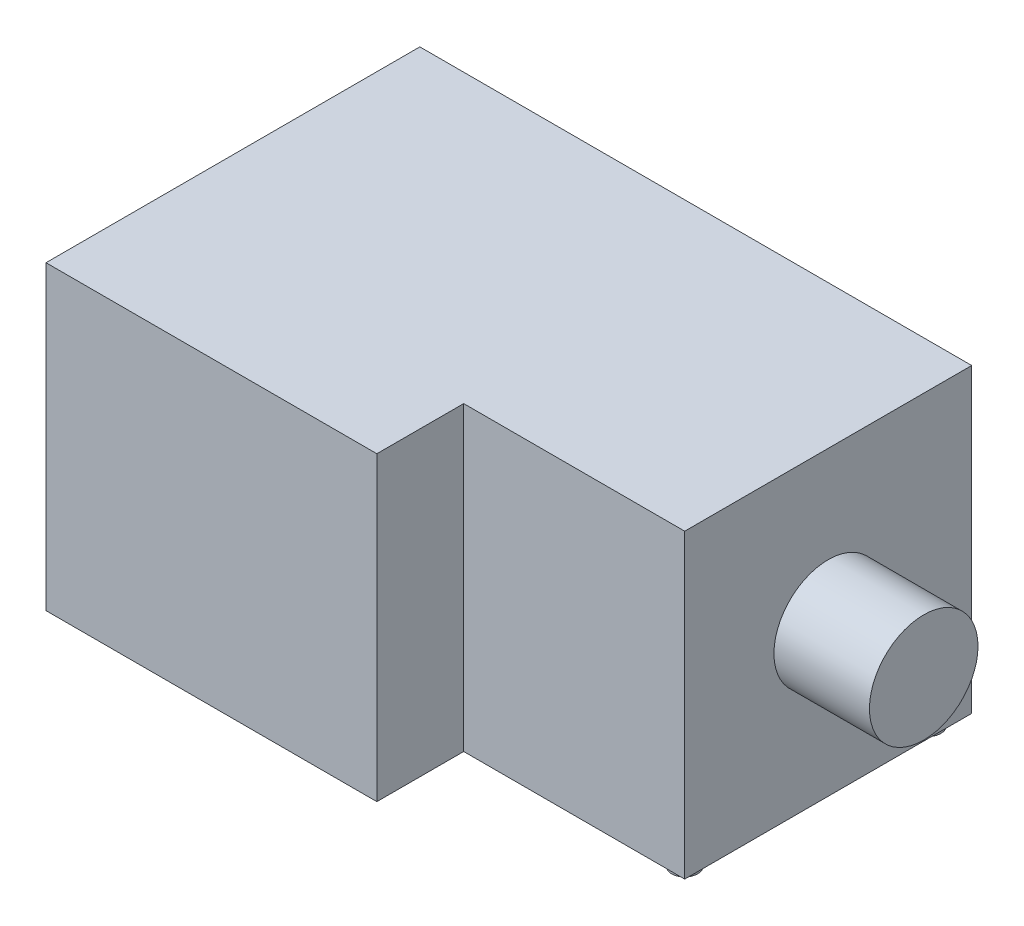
ISO-10303-21;
HEADER;
FILE_DESCRIPTION(('STEP AP214'),'2;1');
FILE_NAME('part.step','',(''),(''),'','','');
FILE_SCHEMA(('AUTOMOTIVE_DESIGN { 1 0 10303 214 1 1 1 1 }'));
ENDSEC;
DATA;
#1=APPLICATION_CONTEXT('core data for automotive mechanical design processes');
#2=APPLICATION_PROTOCOL_DEFINITION('international standard','automotive_design',2000,#1);
#3=PRODUCT_CONTEXT('',#1,'mechanical');
#4=PRODUCT('Part','Part','',(#3));
#5=PRODUCT_RELATED_PRODUCT_CATEGORY('part','',(#4));
#6=PRODUCT_DEFINITION_FORMATION('','',#4);
#7=PRODUCT_DEFINITION_CONTEXT('part definition',#1,'design');
#8=PRODUCT_DEFINITION('design','',#6,#7);
#9=PRODUCT_DEFINITION_SHAPE('','',#8);
#10=(LENGTH_UNIT() NAMED_UNIT(*) SI_UNIT(.MILLI.,.METRE.));
#11=(NAMED_UNIT(*) PLANE_ANGLE_UNIT() SI_UNIT($,.RADIAN.));
#12=(NAMED_UNIT(*) SI_UNIT($,.STERADIAN.) SOLID_ANGLE_UNIT());
#13=UNCERTAINTY_MEASURE_WITH_UNIT(LENGTH_MEASURE(1.E-05),#10,'distance_accuracy_value','');
#14=(GEOMETRIC_REPRESENTATION_CONTEXT(3) GLOBAL_UNCERTAINTY_ASSIGNED_CONTEXT((#13)) GLOBAL_UNIT_ASSIGNED_CONTEXT((#10,
#11,#12)) REPRESENTATION_CONTEXT('',''));
#15=CARTESIAN_POINT('',(0.,0.,0.));
#16=DIRECTION('',(0.,0.,1.));
#17=DIRECTION('',(1.,0.,0.));
#18=AXIS2_PLACEMENT_3D('',#15,#16,#17);
#19=CARTESIAN_POINT('',(0.,694.,0.));
#20=DIRECTION('',(0.,0.,-1.));
#21=DIRECTION('',(-1.,0.,0.));
#22=AXIS2_PLACEMENT_3D('',#19,#20,#21);
#23=PLANE('',#22);
#24=DIRECTION('',(1.,0.,0.));
#25=VECTOR('',#24,1.);
#26=CARTESIAN_POINT('',(0.,0.,0.));
#27=LINE('',#26,#25);
#28=CARTESIAN_POINT('',(762.,0.,0.));
#29=VERTEX_POINT('',#28);
#30=CARTESIAN_POINT('',(1271.,0.,0.));
#31=VERTEX_POINT('',#30);
#32=EDGE_CURVE('E131',#29,#31,#27,.T.);
#33=ORIENTED_EDGE('',*,*,#32,.T.);
#34=DIRECTION('',(0.,-1.,0.));
#35=VECTOR('',#34,1.);
#36=CARTESIAN_POINT('',(1271.,694.,0.));
#37=LINE('',#36,#35);
#38=CARTESIAN_POINT('',(1271.,694.,0.));
#39=VERTEX_POINT('',#38);
#40=EDGE_CURVE('E153',#39,#31,#37,.T.);
#41=ORIENTED_EDGE('',*,*,#40,.F.);
#42=DIRECTION('',(1.,0.,0.));
#43=VECTOR('',#42,1.);
#44=CARTESIAN_POINT('',(0.,694.,0.));
#45=LINE('',#44,#43);
#46=CARTESIAN_POINT('',(762.,694.,0.));
#47=VERTEX_POINT('',#46);
#48=EDGE_CURVE('E146',#47,#39,#45,.T.);
#49=ORIENTED_EDGE('',*,*,#48,.F.);
#50=DIRECTION('',(0.,-1.,0.));
#51=VECTOR('',#50,1.);
#52=CARTESIAN_POINT('',(762.,694.,0.));
#53=LINE('',#52,#51);
#54=EDGE_CURVE('E130',#47,#29,#53,.T.);
#55=ORIENTED_EDGE('',*,*,#54,.T.);
#56=EDGE_LOOP('',(#33,#41,#49,#55));
#57=FACE_BOUND('',#56,.T.);
#58=ADVANCED_FACE('F40',(#57),#23,.F.);
#59=CARTESIAN_POINT('',(1271.,694.,0.));
#60=DIRECTION('',(-1.,0.,0.));
#61=DIRECTION('',(0.,0.,1.));
#62=AXIS2_PLACEMENT_3D('',#59,#60,#61);
#63=PLANE('',#62);
#64=CARTESIAN_POINT('',(1271.,347.,-330.5));
#65=DIRECTION('',(-1.,0.,0.));
#66=DIRECTION('',(0.,0.,1.));
#67=AXIS2_PLACEMENT_3D('',#64,#65,#66);
#68=CIRCLE('',#67,125.);
#69=CARTESIAN_POINT('',(1271.,347.,-205.5));
#70=VERTEX_POINT('',#69);
#71=EDGE_CURVE('E156',#70,#70,#68,.F.);
#72=ORIENTED_EDGE('',*,*,#71,.F.);
#73=EDGE_LOOP('',(#72));
#74=FACE_BOUND('',#73,.T.);
#75=DIRECTION('',(0.,0.,-1.));
#76=VECTOR('',#75,1.);
#77=CARTESIAN_POINT('',(1271.,0.,0.));
#78=LINE('',#77,#76);
#79=CARTESIAN_POINT('',(1271.,0.,-661.));
#80=VERTEX_POINT('',#79);
#81=EDGE_CURVE('E135',#31,#80,#78,.T.);
#82=ORIENTED_EDGE('',*,*,#81,.T.);
#83=DIRECTION('',(0.,-1.,0.));
#84=VECTOR('',#83,1.);
#85=CARTESIAN_POINT('',(1271.,694.,-661.));
#86=LINE('',#85,#84);
#87=CARTESIAN_POINT('',(1271.,694.,-661.));
#88=VERTEX_POINT('',#87);
#89=EDGE_CURVE('E151',#88,#80,#86,.T.);
#90=ORIENTED_EDGE('',*,*,#89,.F.);
#91=DIRECTION('',(0.,0.,-1.));
#92=VECTOR('',#91,1.);
#93=CARTESIAN_POINT('',(1271.,694.,0.));
#94=LINE('',#93,#92);
#95=EDGE_CURVE('E97',#39,#88,#94,.T.);
#96=ORIENTED_EDGE('',*,*,#95,.F.);
#97=ORIENTED_EDGE('',*,*,#40,.T.);
#98=EDGE_LOOP('',(#82,#90,#96,#97));
#99=FACE_BOUND('',#98,.T.);
#100=ADVANCED_FACE('F196',(#74,#99),#63,.F.);
#101=CARTESIAN_POINT('',(0.,694.,-661.));
#102=DIRECTION('',(0.,0.,-1.));
#103=DIRECTION('',(-1.,0.,0.));
#104=AXIS2_PLACEMENT_3D('',#101,#102,#103);
#105=PLANE('',#104);
#106=DIRECTION('',(1.,0.,0.));
#107=VECTOR('',#106,1.);
#108=CARTESIAN_POINT('',(0.,0.,-661.));
#109=LINE('',#108,#107);
#110=CARTESIAN_POINT('',(0.,0.,-661.));
#111=VERTEX_POINT('',#110);
#112=EDGE_CURVE('E140',#111,#80,#109,.T.);
#113=ORIENTED_EDGE('',*,*,#112,.F.);
#114=DIRECTION('',(0.,-1.,0.));
#115=VECTOR('',#114,1.);
#116=CARTESIAN_POINT('',(0.,694.,-661.));
#117=LINE('',#116,#115);
#118=CARTESIAN_POINT('',(0.,694.,-661.));
#119=VERTEX_POINT('',#118);
#120=EDGE_CURVE('E113',#119,#111,#117,.T.);
#121=ORIENTED_EDGE('',*,*,#120,.F.);
#122=DIRECTION('',(1.,0.,0.));
#123=VECTOR('',#122,1.);
#124=CARTESIAN_POINT('',(0.,694.,-661.));
#125=LINE('',#124,#123);
#126=EDGE_CURVE('E122',#119,#88,#125,.T.);
#127=ORIENTED_EDGE('',*,*,#126,.T.);
#128=ORIENTED_EDGE('',*,*,#89,.T.);
#129=EDGE_LOOP('',(#113,#121,#127,#128));
#130=FACE_BOUND('',#129,.T.);
#131=ADVANCED_FACE('F200',(#130),#105,.T.);
#132=CARTESIAN_POINT('',(0.,694.,0.));
#133=DIRECTION('',(-1.,0.,0.));
#134=DIRECTION('',(0.,0.,1.));
#135=AXIS2_PLACEMENT_3D('',#132,#133,#134);
#136=PLANE('',#135);
#137=DIRECTION('',(0.,0.,-1.));
#138=VECTOR('',#137,1.);
#139=CARTESIAN_POINT('',(0.,0.,0.));
#140=LINE('',#139,#138);
#141=CARTESIAN_POINT('',(0.,0.,200.));
#142=VERTEX_POINT('',#141);
#143=EDGE_CURVE('E112',#142,#111,#140,.T.);
#144=ORIENTED_EDGE('',*,*,#143,.F.);
#145=DIRECTION('',(0.,-1.,0.));
#146=VECTOR('',#145,1.);
#147=CARTESIAN_POINT('',(0.,694.,200.));
#148=LINE('',#147,#146);
#149=CARTESIAN_POINT('',(0.,694.,200.));
#150=VERTEX_POINT('',#149);
#151=EDGE_CURVE('E106',#150,#142,#148,.T.);
#152=ORIENTED_EDGE('',*,*,#151,.F.);
#153=DIRECTION('',(0.,0.,-1.));
#154=VECTOR('',#153,1.);
#155=CARTESIAN_POINT('',(0.,694.,0.));
#156=LINE('',#155,#154);
#157=EDGE_CURVE('E110',#150,#119,#156,.T.);
#158=ORIENTED_EDGE('',*,*,#157,.T.);
#159=ORIENTED_EDGE('',*,*,#120,.T.);
#160=EDGE_LOOP('',(#144,#152,#158,#159));
#161=FACE_BOUND('',#160,.T.);
#162=ADVANCED_FACE('F108',(#161),#136,.T.);
#163=CARTESIAN_POINT('',(0.,694.,200.));
#164=DIRECTION('',(0.,0.,-1.));
#165=DIRECTION('',(-1.,0.,0.));
#166=AXIS2_PLACEMENT_3D('',#163,#164,#165);
#167=PLANE('',#166);
#168=DIRECTION('',(1.,0.,0.));
#169=VECTOR('',#168,1.);
#170=CARTESIAN_POINT('',(0.,0.,200.));
#171=LINE('',#170,#169);
#172=CARTESIAN_POINT('',(762.,0.,200.));
#173=VERTEX_POINT('',#172);
#174=EDGE_CURVE('E82',#142,#173,#171,.T.);
#175=ORIENTED_EDGE('',*,*,#174,.T.);
#176=DIRECTION('',(0.,-1.,0.));
#177=VECTOR('',#176,1.);
#178=CARTESIAN_POINT('',(762.,694.,200.));
#179=LINE('',#178,#177);
#180=CARTESIAN_POINT('',(762.,694.,200.));
#181=VERTEX_POINT('',#180);
#182=EDGE_CURVE('E114',#181,#173,#179,.T.);
#183=ORIENTED_EDGE('',*,*,#182,.F.);
#184=DIRECTION('',(1.,0.,0.));
#185=VECTOR('',#184,1.);
#186=CARTESIAN_POINT('',(0.,694.,200.));
#187=LINE('',#186,#185);
#188=EDGE_CURVE('E116',#150,#181,#187,.T.);
#189=ORIENTED_EDGE('',*,*,#188,.F.);
#190=ORIENTED_EDGE('',*,*,#151,.T.);
#191=EDGE_LOOP('',(#175,#183,#189,#190));
#192=FACE_BOUND('',#191,.T.);
#193=ADVANCED_FACE('F117',(#192),#167,.F.);
#194=CARTESIAN_POINT('',(762.,694.,0.));
#195=DIRECTION('',(-1.,0.,0.));
#196=DIRECTION('',(0.,0.,1.));
#197=AXIS2_PLACEMENT_3D('',#194,#195,#196);
#198=PLANE('',#197);
#199=DIRECTION('',(0.,0.,-1.));
#200=VECTOR('',#199,1.);
#201=CARTESIAN_POINT('',(762.,0.,0.));
#202=LINE('',#201,#200);
#203=EDGE_CURVE('E88',#173,#29,#202,.T.);
#204=ORIENTED_EDGE('',*,*,#203,.T.);
#205=ORIENTED_EDGE('',*,*,#54,.F.);
#206=DIRECTION('',(0.,0.,-1.));
#207=VECTOR('',#206,1.);
#208=CARTESIAN_POINT('',(762.,694.,0.));
#209=LINE('',#208,#207);
#210=EDGE_CURVE('E59',#181,#47,#209,.T.);
#211=ORIENTED_EDGE('',*,*,#210,.F.);
#212=ORIENTED_EDGE('',*,*,#182,.T.);
#213=EDGE_LOOP('',(#204,#205,#211,#212));
#214=FACE_BOUND('',#213,.T.);
#215=ADVANCED_FACE('F186',(#214),#198,.F.);
#216=CARTESIAN_POINT('',(0.,694.,0.));
#217=DIRECTION('',(0.,1.,0.));
#218=DIRECTION('',(0.,0.,1.));
#219=AXIS2_PLACEMENT_3D('',#216,#217,#218);
#220=PLANE('',#219);
#221=ORIENTED_EDGE('',*,*,#48,.T.);
#222=ORIENTED_EDGE('',*,*,#95,.T.);
#223=ORIENTED_EDGE('',*,*,#126,.F.);
#224=ORIENTED_EDGE('',*,*,#157,.F.);
#225=ORIENTED_EDGE('',*,*,#188,.T.);
#226=ORIENTED_EDGE('',*,*,#210,.T.);
#227=EDGE_LOOP('',(#221,#222,#223,#224,#225,#226));
#228=FACE_BOUND('',#227,.T.);
#229=ADVANCED_FACE('F120',(#228),#220,.T.);
#230=CARTESIAN_POINT('',(0.,0.,0.));
#231=DIRECTION('',(0.,1.,0.));
#232=DIRECTION('',(0.,0.,1.));
#233=AXIS2_PLACEMENT_3D('',#230,#231,#232);
#234=PLANE('',#233);
#235=CARTESIAN_POINT('',(1220.5,0.,-50.5));
#236=DIRECTION('',(0.,1.,0.));
#237=DIRECTION('',(0.,0.,1.));
#238=AXIS2_PLACEMENT_3D('',#235,#236,#237);
#239=CIRCLE('',#238,30.);
#240=CARTESIAN_POINT('',(1220.5,0.,-20.4999999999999));
#241=VERTEX_POINT('',#240);
#242=EDGE_CURVE('E11',#241,#241,#239,.F.);
#243=ORIENTED_EDGE('',*,*,#242,.F.);
#244=EDGE_LOOP('',(#243));
#245=FACE_BOUND('',#244,.T.);
#246=CARTESIAN_POINT('',(1220.5,0.,-610.5));
#247=DIRECTION('',(0.,1.,0.));
#248=DIRECTION('',(0.,0.,1.));
#249=AXIS2_PLACEMENT_3D('',#246,#247,#248);
#250=CIRCLE('',#249,30.0000000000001);
#251=CARTESIAN_POINT('',(1220.5,0.,-580.5));
#252=VERTEX_POINT('',#251);
#253=EDGE_CURVE('E49',#252,#252,#250,.F.);
#254=ORIENTED_EDGE('',*,*,#253,.F.);
#255=EDGE_LOOP('',(#254));
#256=FACE_BOUND('',#255,.T.);
#257=CARTESIAN_POINT('',(50.5000000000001,0.,-610.5));
#258=DIRECTION('',(0.,1.,0.));
#259=DIRECTION('',(0.,0.,1.));
#260=AXIS2_PLACEMENT_3D('',#257,#258,#259);
#261=CIRCLE('',#260,30.);
#262=CARTESIAN_POINT('',(50.5000000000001,0.,-580.5));
#263=VERTEX_POINT('',#262);
#264=EDGE_CURVE('E163',#263,#263,#261,.F.);
#265=ORIENTED_EDGE('',*,*,#264,.F.);
#266=EDGE_LOOP('',(#265));
#267=FACE_BOUND('',#266,.T.);
#268=CARTESIAN_POINT('',(50.5,0.,-50.5));
#269=DIRECTION('',(0.,1.,0.));
#270=DIRECTION('',(0.,0.,1.));
#271=AXIS2_PLACEMENT_3D('',#268,#269,#270);
#272=CIRCLE('',#271,30.);
#273=CARTESIAN_POINT('',(50.5,0.,-20.5));
#274=VERTEX_POINT('',#273);
#275=EDGE_CURVE('E160',#274,#274,#272,.F.);
#276=ORIENTED_EDGE('',*,*,#275,.F.);
#277=EDGE_LOOP('',(#276));
#278=FACE_BOUND('',#277,.T.);
#279=ORIENTED_EDGE('',*,*,#32,.F.);
#280=ORIENTED_EDGE('',*,*,#203,.F.);
#281=ORIENTED_EDGE('',*,*,#174,.F.);
#282=ORIENTED_EDGE('',*,*,#143,.T.);
#283=ORIENTED_EDGE('',*,*,#112,.T.);
#284=ORIENTED_EDGE('',*,*,#81,.F.);
#285=EDGE_LOOP('',(#279,#280,#281,#282,#283,#284));
#286=FACE_BOUND('',#285,.T.);
#287=ADVANCED_FACE('F170',(#245,#256,#267,#278,#286),#234,.F.);
#288=CARTESIAN_POINT('',(1491.,347.,-330.5));
#289=DIRECTION('',(-1.,0.,0.));
#290=DIRECTION('',(0.,0.,1.));
#291=AXIS2_PLACEMENT_3D('',#288,#289,#290);
#292=CYLINDRICAL_SURFACE('',#291,125.);
#293=CARTESIAN_POINT('',(1491.,347.,-330.5));
#294=DIRECTION('',(1.,0.,0.));
#295=DIRECTION('',(0.,0.,-1.));
#296=AXIS2_PLACEMENT_3D('',#293,#294,#295);
#297=CIRCLE('',#296,125.);
#298=CARTESIAN_POINT('',(1491.,347.,-455.5));
#299=VERTEX_POINT('',#298);
#300=EDGE_CURVE('E136',#299,#299,#297,.T.);
#301=ORIENTED_EDGE('',*,*,#300,.F.);
#302=EDGE_LOOP('',(#301));
#303=FACE_BOUND('',#302,.T.);
#304=ORIENTED_EDGE('',*,*,#71,.T.);
#305=EDGE_LOOP('',(#304));
#306=FACE_BOUND('',#305,.T.);
#307=ADVANCED_FACE('F173',(#303,#306),#292,.T.);
#308=CARTESIAN_POINT('',(1491.,347.,-330.5));
#309=DIRECTION('',(1.,0.,0.));
#310=DIRECTION('',(0.,0.,-1.));
#311=AXIS2_PLACEMENT_3D('',#308,#309,#310);
#312=PLANE('',#311);
#313=ORIENTED_EDGE('',*,*,#300,.T.);
#314=EDGE_LOOP('',(#313));
#315=FACE_BOUND('',#314,.T.);
#316=ADVANCED_FACE('F246',(#315),#312,.T.);
#317=CARTESIAN_POINT('',(50.5,-25.,-50.5));
#318=DIRECTION('',(0.,-1.,0.));
#319=DIRECTION('',(0.,0.,-1.));
#320=AXIS2_PLACEMENT_3D('',#317,#318,#319);
#321=PLANE('',#320);
#322=CARTESIAN_POINT('',(50.5,-25.,-50.5));
#323=DIRECTION('',(0.,-1.,0.));
#324=DIRECTION('',(0.,0.,-1.));
#325=AXIS2_PLACEMENT_3D('',#322,#323,#324);
#326=CIRCLE('',#325,30.);
#327=CARTESIAN_POINT('',(50.5,-25.,-80.5));
#328=VERTEX_POINT('',#327);
#329=EDGE_CURVE('E462',#328,#328,#326,.T.);
#330=ORIENTED_EDGE('',*,*,#329,.T.);
#331=EDGE_LOOP('',(#330));
#332=FACE_BOUND('',#331,.T.);
#333=CARTESIAN_POINT('',(50.5,-25.,-50.5));
#334=DIRECTION('',(0.,-1.,0.));
#335=DIRECTION('',(0.,0.,-1.));
#336=AXIS2_PLACEMENT_3D('',#333,#334,#335);
#337=CIRCLE('',#336,5.);
#338=CARTESIAN_POINT('',(50.5,-25.,-55.5));
#339=VERTEX_POINT('',#338);
#340=EDGE_CURVE('E459',#339,#339,#337,.T.);
#341=ORIENTED_EDGE('',*,*,#340,.F.);
#342=EDGE_LOOP('',(#341));
#343=FACE_BOUND('',#342,.T.);
#344=ADVANCED_FACE('F257',(#332,#343),#321,.T.);
#345=CARTESIAN_POINT('',(50.5,-25.,-50.5));
#346=DIRECTION('',(0.,1.,0.));
#347=DIRECTION('',(0.,0.,1.));
#348=AXIS2_PLACEMENT_3D('',#345,#346,#347);
#349=CYLINDRICAL_SURFACE('',#348,30.);
#350=ORIENTED_EDGE('',*,*,#329,.F.);
#351=EDGE_LOOP('',(#350));
#352=FACE_BOUND('',#351,.T.);
#353=ORIENTED_EDGE('',*,*,#275,.T.);
#354=EDGE_LOOP('',(#353));
#355=FACE_BOUND('',#354,.T.);
#356=ADVANCED_FACE('F272',(#352,#355),#349,.T.);
#357=CARTESIAN_POINT('',(50.5,-25.,-50.5));
#358=DIRECTION('',(0.,1.,0.));
#359=DIRECTION('',(0.,0.,1.));
#360=AXIS2_PLACEMENT_3D('',#357,#358,#359);
#361=CYLINDRICAL_SURFACE('',#360,5.);
#362=ORIENTED_EDGE('',*,*,#340,.T.);
#363=EDGE_LOOP('',(#362));
#364=FACE_BOUND('',#363,.T.);
#365=CARTESIAN_POINT('',(50.5,0.,-50.5));
#366=DIRECTION('',(0.,-1.,0.));
#367=DIRECTION('',(0.,0.,-1.));
#368=AXIS2_PLACEMENT_3D('',#365,#366,#367);
#369=CIRCLE('',#368,5.);
#370=CARTESIAN_POINT('',(50.5,0.,-55.5));
#371=VERTEX_POINT('',#370);
#372=EDGE_CURVE('E458',#371,#371,#369,.T.);
#373=ORIENTED_EDGE('',*,*,#372,.F.);
#374=EDGE_LOOP('',(#373));
#375=FACE_BOUND('',#374,.T.);
#376=ADVANCED_FACE('F283',(#364,#375),#361,.F.);
#377=ORIENTED_EDGE('',*,*,#372,.T.);
#378=EDGE_LOOP('',(#377));
#379=FACE_BOUND('',#378,.T.);
#380=ADVANCED_FACE('F177',(#379),#234,.F.);
#381=CARTESIAN_POINT('',(50.5000000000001,-25.,-610.5));
#382=DIRECTION('',(0.,-1.,0.));
#383=DIRECTION('',(0.,0.,-1.));
#384=AXIS2_PLACEMENT_3D('',#381,#382,#383);
#385=PLANE('',#384);
#386=CARTESIAN_POINT('',(50.5000000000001,-25.,-610.5));
#387=DIRECTION('',(0.,-1.,0.));
#388=DIRECTION('',(0.,0.,-1.));
#389=AXIS2_PLACEMENT_3D('',#386,#387,#388);
#390=CIRCLE('',#389,30.);
#391=CARTESIAN_POINT('',(50.5000000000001,-25.,-640.5));
#392=VERTEX_POINT('',#391);
#393=EDGE_CURVE('E453',#392,#392,#390,.T.);
#394=ORIENTED_EDGE('',*,*,#393,.T.);
#395=EDGE_LOOP('',(#394));
#396=FACE_BOUND('',#395,.T.);
#397=CARTESIAN_POINT('',(50.5000000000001,-25.,-610.5));
#398=DIRECTION('',(0.,-1.,0.));
#399=DIRECTION('',(0.,0.,-1.));
#400=AXIS2_PLACEMENT_3D('',#397,#398,#399);
#401=CIRCLE('',#400,5.);
#402=CARTESIAN_POINT('',(50.5000000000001,-25.,-615.5));
#403=VERTEX_POINT('',#402);
#404=EDGE_CURVE('E450',#403,#403,#401,.T.);
#405=ORIENTED_EDGE('',*,*,#404,.F.);
#406=EDGE_LOOP('',(#405));
#407=FACE_BOUND('',#406,.T.);
#408=ADVANCED_FACE('F303',(#396,#407),#385,.T.);
#409=CARTESIAN_POINT('',(50.5000000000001,-25.,-610.5));
#410=DIRECTION('',(0.,1.,0.));
#411=DIRECTION('',(0.,0.,1.));
#412=AXIS2_PLACEMENT_3D('',#409,#410,#411);
#413=CYLINDRICAL_SURFACE('',#412,30.);
#414=ORIENTED_EDGE('',*,*,#393,.F.);
#415=EDGE_LOOP('',(#414));
#416=FACE_BOUND('',#415,.T.);
#417=ORIENTED_EDGE('',*,*,#264,.T.);
#418=EDGE_LOOP('',(#417));
#419=FACE_BOUND('',#418,.T.);
#420=ADVANCED_FACE('F313',(#416,#419),#413,.T.);
#421=CARTESIAN_POINT('',(50.5000000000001,-25.,-610.5));
#422=DIRECTION('',(0.,1.,0.));
#423=DIRECTION('',(0.,0.,1.));
#424=AXIS2_PLACEMENT_3D('',#421,#422,#423);
#425=CYLINDRICAL_SURFACE('',#424,5.);
#426=ORIENTED_EDGE('',*,*,#404,.T.);
#427=EDGE_LOOP('',(#426));
#428=FACE_BOUND('',#427,.T.);
#429=CARTESIAN_POINT('',(50.5000000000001,0.,-610.5));
#430=DIRECTION('',(0.,-1.,0.));
#431=DIRECTION('',(0.,0.,-1.));
#432=AXIS2_PLACEMENT_3D('',#429,#430,#431);
#433=CIRCLE('',#432,5.);
#434=CARTESIAN_POINT('',(50.5000000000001,0.,-615.5));
#435=VERTEX_POINT('',#434);
#436=EDGE_CURVE('E449',#435,#435,#433,.T.);
#437=ORIENTED_EDGE('',*,*,#436,.F.);
#438=EDGE_LOOP('',(#437));
#439=FACE_BOUND('',#438,.T.);
#440=ADVANCED_FACE('F323',(#428,#439),#425,.F.);
#441=ORIENTED_EDGE('',*,*,#436,.T.);
#442=EDGE_LOOP('',(#441));
#443=FACE_BOUND('',#442,.T.);
#444=ADVANCED_FACE('F305',(#443),#234,.F.);
#445=CARTESIAN_POINT('',(1220.5,-25.,-610.5));
#446=DIRECTION('',(0.,-1.,0.));
#447=DIRECTION('',(0.,0.,-1.));
#448=AXIS2_PLACEMENT_3D('',#445,#446,#447);
#449=PLANE('',#448);
#450=CARTESIAN_POINT('',(1220.5,-25.,-610.5));
#451=DIRECTION('',(0.,-1.,0.));
#452=DIRECTION('',(0.,0.,-1.));
#453=AXIS2_PLACEMENT_3D('',#450,#451,#452);
#454=CIRCLE('',#453,30.0000000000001);
#455=CARTESIAN_POINT('',(1220.5,-25.,-640.5));
#456=VERTEX_POINT('',#455);
#457=EDGE_CURVE('E444',#456,#456,#454,.T.);
#458=ORIENTED_EDGE('',*,*,#457,.T.);
#459=EDGE_LOOP('',(#458));
#460=FACE_BOUND('',#459,.T.);
#461=CARTESIAN_POINT('',(1220.5,-25.,-610.5));
#462=DIRECTION('',(0.,-1.,0.));
#463=DIRECTION('',(0.,0.,-1.));
#464=AXIS2_PLACEMENT_3D('',#461,#462,#463);
#465=CIRCLE('',#464,4.99999999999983);
#466=CARTESIAN_POINT('',(1220.5,-25.,-615.5));
#467=VERTEX_POINT('',#466);
#468=EDGE_CURVE('E441',#467,#467,#465,.T.);
#469=ORIENTED_EDGE('',*,*,#468,.F.);
#470=EDGE_LOOP('',(#469));
#471=FACE_BOUND('',#470,.T.);
#472=ADVANCED_FACE('F343',(#460,#471),#449,.T.);
#473=CARTESIAN_POINT('',(1220.5,-25.,-610.5));
#474=DIRECTION('',(0.,1.,0.));
#475=DIRECTION('',(0.,0.,1.));
#476=AXIS2_PLACEMENT_3D('',#473,#474,#475);
#477=CYLINDRICAL_SURFACE('',#476,30.0000000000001);
#478=ORIENTED_EDGE('',*,*,#457,.F.);
#479=EDGE_LOOP('',(#478));
#480=FACE_BOUND('',#479,.T.);
#481=ORIENTED_EDGE('',*,*,#253,.T.);
#482=EDGE_LOOP('',(#481));
#483=FACE_BOUND('',#482,.T.);
#484=ADVANCED_FACE('F168',(#480,#483),#477,.T.);
#485=CARTESIAN_POINT('',(1220.5,-25.,-610.5));
#486=DIRECTION('',(0.,1.,0.));
#487=DIRECTION('',(0.,0.,1.));
#488=AXIS2_PLACEMENT_3D('',#485,#486,#487);
#489=CYLINDRICAL_SURFACE('',#488,4.99999999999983);
#490=ORIENTED_EDGE('',*,*,#468,.T.);
#491=EDGE_LOOP('',(#490));
#492=FACE_BOUND('',#491,.T.);
#493=CARTESIAN_POINT('',(1220.5,0.,-610.5));
#494=DIRECTION('',(0.,-1.,0.));
#495=DIRECTION('',(0.,0.,-1.));
#496=AXIS2_PLACEMENT_3D('',#493,#494,#495);
#497=CIRCLE('',#496,4.99999999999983);
#498=CARTESIAN_POINT('',(1220.5,0.,-615.5));
#499=VERTEX_POINT('',#498);
#500=EDGE_CURVE('E440',#499,#499,#497,.T.);
#501=ORIENTED_EDGE('',*,*,#500,.F.);
#502=EDGE_LOOP('',(#501));
#503=FACE_BOUND('',#502,.T.);
#504=ADVANCED_FACE('F362',(#492,#503),#489,.F.);
#505=ORIENTED_EDGE('',*,*,#500,.T.);
#506=EDGE_LOOP('',(#505));
#507=FACE_BOUND('',#506,.T.);
#508=ADVANCED_FACE('F345',(#507),#234,.F.);
#509=CARTESIAN_POINT('',(1220.5,-25.,-50.5));
#510=DIRECTION('',(0.,-1.,0.));
#511=DIRECTION('',(0.,0.,-1.));
#512=AXIS2_PLACEMENT_3D('',#509,#510,#511);
#513=PLANE('',#512);
#514=CARTESIAN_POINT('',(1220.5,-25.,-50.5));
#515=DIRECTION('',(0.,-1.,0.));
#516=DIRECTION('',(0.,0.,-1.));
#517=AXIS2_PLACEMENT_3D('',#514,#515,#516);
#518=CIRCLE('',#517,30.);
#519=CARTESIAN_POINT('',(1220.5,-25.,-80.5));
#520=VERTEX_POINT('',#519);
#521=EDGE_CURVE('E434',#520,#520,#518,.T.);
#522=ORIENTED_EDGE('',*,*,#521,.T.);
#523=EDGE_LOOP('',(#522));
#524=FACE_BOUND('',#523,.T.);
#525=CARTESIAN_POINT('',(1220.5,-25.,-50.5));
#526=DIRECTION('',(0.,-1.,0.));
#527=DIRECTION('',(0.,0.,-1.));
#528=AXIS2_PLACEMENT_3D('',#525,#526,#527);
#529=CIRCLE('',#528,4.99999999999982);
#530=CARTESIAN_POINT('',(1220.5,-25.,-55.4999999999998));
#531=VERTEX_POINT('',#530);
#532=EDGE_CURVE('E429',#531,#531,#529,.T.);
#533=ORIENTED_EDGE('',*,*,#532,.F.);
#534=EDGE_LOOP('',(#533));
#535=FACE_BOUND('',#534,.T.);
#536=ADVANCED_FACE('F382',(#524,#535),#513,.T.);
#537=CARTESIAN_POINT('',(1220.5,-25.,-50.5));
#538=DIRECTION('',(0.,1.,0.));
#539=DIRECTION('',(0.,0.,1.));
#540=AXIS2_PLACEMENT_3D('',#537,#538,#539);
#541=CYLINDRICAL_SURFACE('',#540,30.);
#542=ORIENTED_EDGE('',*,*,#521,.F.);
#543=EDGE_LOOP('',(#542));
#544=FACE_BOUND('',#543,.T.);
#545=ORIENTED_EDGE('',*,*,#242,.T.);
#546=EDGE_LOOP('',(#545));
#547=FACE_BOUND('',#546,.T.);
#548=ADVANCED_FACE('F391',(#544,#547),#541,.T.);
#549=CARTESIAN_POINT('',(1220.5,-25.,-50.5));
#550=DIRECTION('',(0.,1.,0.));
#551=DIRECTION('',(0.,0.,1.));
#552=AXIS2_PLACEMENT_3D('',#549,#550,#551);
#553=CYLINDRICAL_SURFACE('',#552,4.99999999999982);
#554=ORIENTED_EDGE('',*,*,#532,.T.);
#555=EDGE_LOOP('',(#554));
#556=FACE_BOUND('',#555,.T.);
#557=CARTESIAN_POINT('',(1220.5,0.,-50.5));
#558=DIRECTION('',(0.,-1.,0.));
#559=DIRECTION('',(0.,0.,-1.));
#560=AXIS2_PLACEMENT_3D('',#557,#558,#559);
#561=CIRCLE('',#560,4.99999999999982);
#562=CARTESIAN_POINT('',(1220.5,0.,-55.4999999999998));
#563=VERTEX_POINT('',#562);
#564=EDGE_CURVE('E426',#563,#563,#561,.T.);
#565=ORIENTED_EDGE('',*,*,#564,.F.);
#566=EDGE_LOOP('',(#565));
#567=FACE_BOUND('',#566,.T.);
#568=ADVANCED_FACE('F401',(#556,#567),#553,.F.);
#569=ORIENTED_EDGE('',*,*,#564,.T.);
#570=EDGE_LOOP('',(#569));
#571=FACE_BOUND('',#570,.T.);
#572=ADVANCED_FACE('F176',(#571),#234,.F.);
#573=CLOSED_SHELL('',(#58,#100,#131,#162,#193,#215,#229,#287,#307,#316,#344,#356,#376,#380,#408,
#420,#440,#444,#472,#484,#504,#508,#536,#548,#568,#572));
#574=MANIFOLD_SOLID_BREP('B2',#573);
#575=ADVANCED_BREP_SHAPE_REPRESENTATION('',(#18,#574),#14);
#576=SHAPE_DEFINITION_REPRESENTATION(#9,#575);
ENDSEC;
END-ISO-10303-21;
